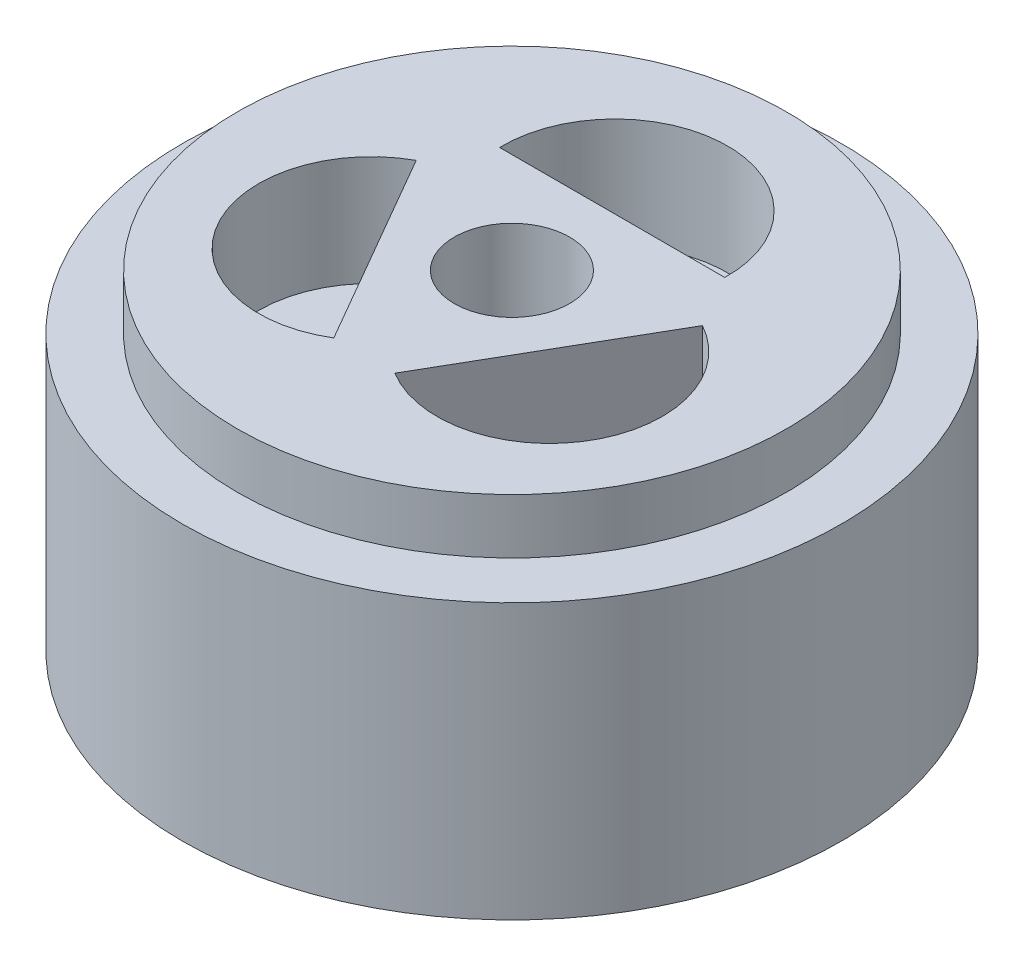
from build123d import *

# Parameters (mm, degrees)
SKETCH3_R           = 12
BOSS_EXTRUDE1_DEPTH = 10
SKETCH4_R           = 10
BOSS_EXTRUDE2_DEPTH = 2
CUT_EXTRUDE1_DEPTH  = 4
SKETCH7_R           = 2.1
CUT_EXTRUDE2_DEPTH  = 20


with BuildPart() as part:
    # Sketch3 → Boss-Extrude1 (new body)
    with BuildSketch(Plane(origin=(0, 0, 0), x_dir=(1, 0, 0), z_dir=(0, 1, 0))):
        with Locations(Location((0, 0, 0), (0, 0, 270))):
            Circle(SKETCH3_R)
    extrude(amount=BOSS_EXTRUDE1_DEPTH)

    # Sketch4 → Boss-Extrude2 (add)
    with BuildSketch(Plane(origin=(0, 10, 0), x_dir=(1, 0, 0), z_dir=(0, 1, 0))):
        with Locations(Location((0, 0, 0), (0, 0, 270))):
            Circle(SKETCH4_R)
    extrude(amount=BOSS_EXTRUDE2_DEPTH)

    # Sketch6 → Cut-Extrude1 (cut)
    with BuildSketch(Plane(origin=(0, 12, 0), x_dir=(1, 0, 0), z_dir=(0, 1, 0))):
        with BuildLine():
            Line((-4.098780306, 3.65), (4.098780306, 3.65))
            ThreePointArc((4.098780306, 3.65), (0, 7.85), (-4.098780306, 3.65))
        make_face()
        with BuildLine():
            Line((5.210382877, 1.72464787), (1.111602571, -5.37464787))
            ThreePointArc((1.111602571, -5.37464787), (6.79829942, -3.925), (5.210382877, 1.72464787))
        make_face()
        with BuildLine():
            Line((-1.111602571, -5.37464787), (-5.210382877, 1.72464787))
            ThreePointArc((-5.210382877, 1.72464787), (-6.79829942, -3.925), (-1.111602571, -5.37464787))
        make_face()
    extrude(amount=-CUT_EXTRUDE1_DEPTH, mode=Mode.SUBTRACT)

    # Sketch7 → Cut-Extrude2 (cut)
    with BuildSketch(Plane(origin=(0, 12, 0), x_dir=(1, 0, 0), z_dir=(0, 1, 0))):
        with Locations(Location((0, 0, 0), (0, 0, 270))):
            Circle(SKETCH7_R)
    extrude(amount=-CUT_EXTRUDE2_DEPTH, mode=Mode.SUBTRACT)


solid = part.part
